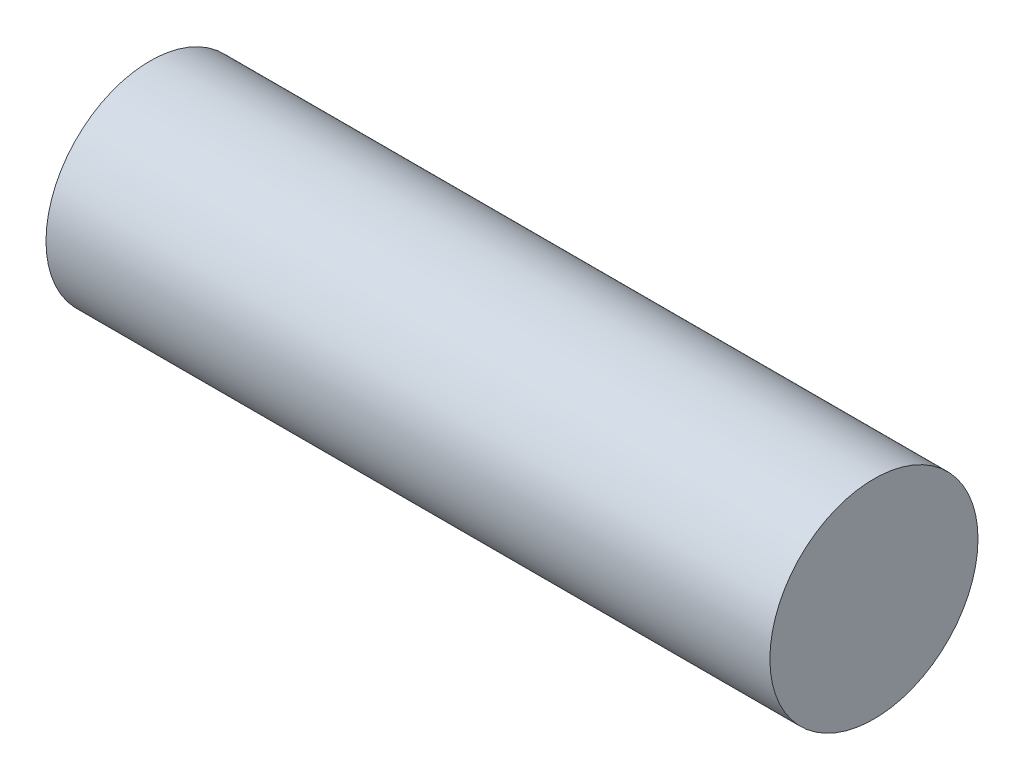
from build123d import *

# Parameters (mm, degrees)
SKETCH1_R           = 1.4605
BOSS_EXTRUDE1_DEPTH = 5.08


with BuildPart() as part:
    # Sketch1 → Boss-Extrude1 (new, symmetric)
    with BuildSketch(Plane(origin=(0, 0, 0), x_dir=(0, 0, -1), z_dir=(1, 0, 0))):
        Circle(SKETCH1_R)
    extrude(amount=BOSS_EXTRUDE1_DEPTH, both=True)


solid = part.part
